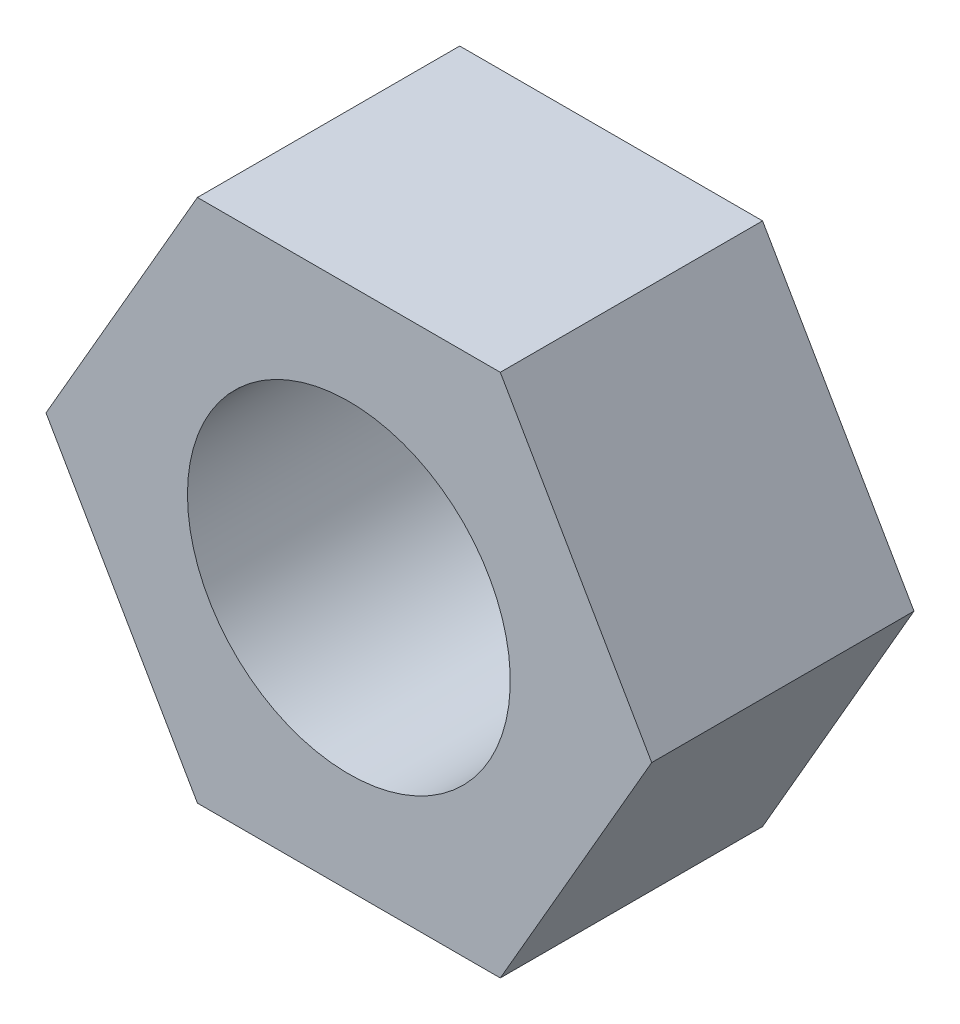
from build123d import *

# Parameters (mm, degrees)
SKETCH_1_R      = 4
EXTRUDE_1_DEPTH = 6.5


with BuildPart() as part:
    # Sketch 1 → Extrude 1 (new body)
    with BuildSketch(Plane.XY):
        Polygon((3.75277675, -6.5), (7.505553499, 0), (3.75277675, 6.5), (-3.75277675, 6.5), (-7.505553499, 0), (-3.75277675, -6.5), align=None)
        with Locations(Location((0, 0, 0), (0, 0, 180))):
            Circle(SKETCH_1_R, mode=Mode.SUBTRACT)
    extrude(amount=EXTRUDE_1_DEPTH)


solid = part.part
